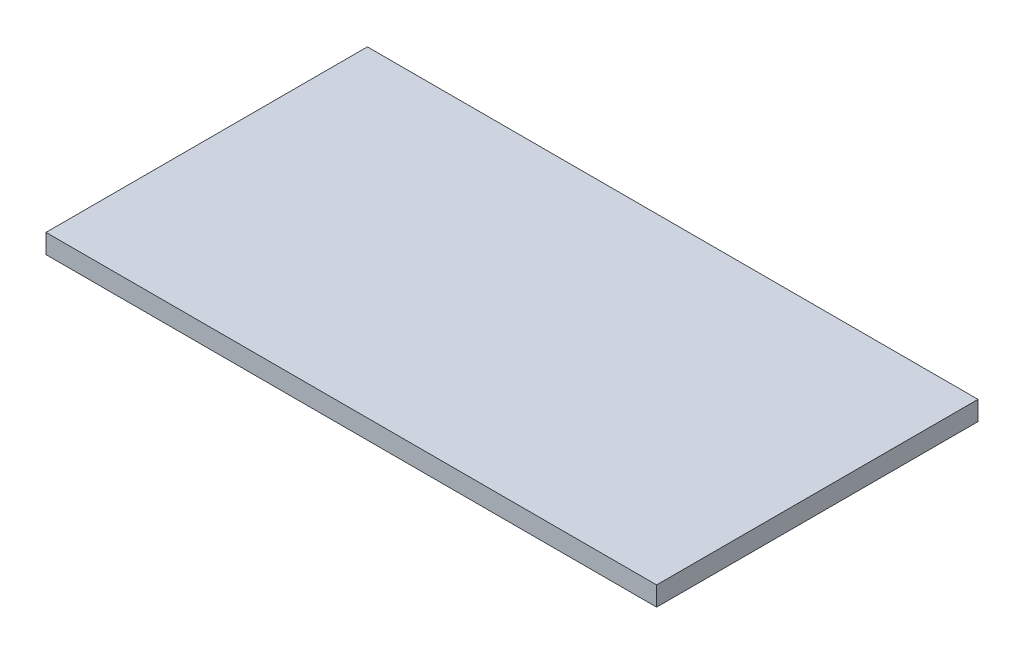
from build123d import *

# Parameters (mm, degrees)
ESBO_O2_W                = 120
ESBO_O2_H                = 100
RESSALTO_EXTRUS_O1_DEPTH = 6
ESBO_O3_W                = 100
ESBO_O3_H                = 6
RESSALTO_EXTRUS_O3_DEPTH = 70


with BuildPart() as part:
    # Esbo_o2 → Ressalto-extrus_o1 (new body)
    with BuildSketch(Plane(origin=(0, 0, 0), x_dir=(1, 0, 0), z_dir=(0, 1, 0))):
        with Locations((60, 50)):
            Rectangle(ESBO_O2_W, ESBO_O2_H)
    extrude(amount=RESSALTO_EXTRUS_O1_DEPTH)

    # Esbo_o3 → Ressalto-extrus_o3 (add)
    with BuildSketch(Plane.ZY):
        with Locations((-50, 3)):
            Rectangle(ESBO_O3_W, ESBO_O3_H)
    extrude(amount=RESSALTO_EXTRUS_O3_DEPTH)


solid = part.part
